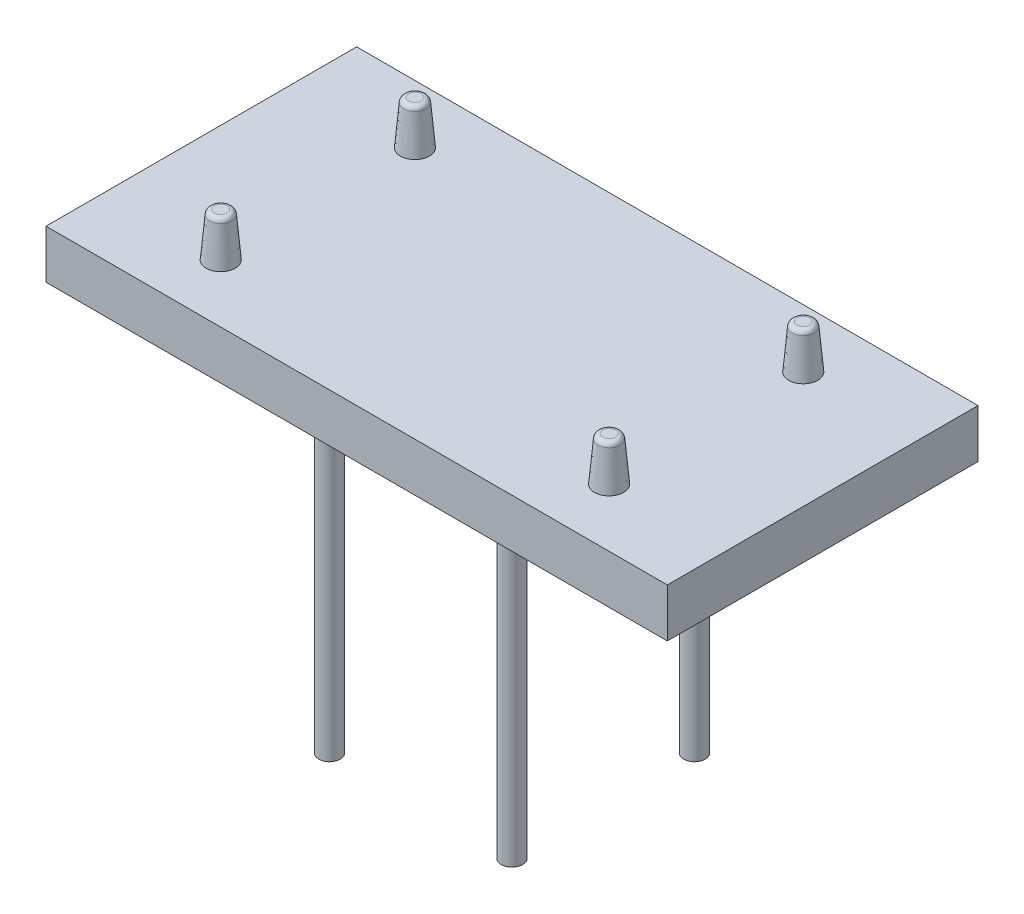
from build123d import *

# Parameters (mm, degrees)
SKETCH1_W                = 320
SKETCH1_H                = 160
EXTRUDE1_DEPTH           = 25
SKETCH1_3_R              = 7.5
EXTRUDE2_DEPTH           = 22.5
EXTRUDE2_DRAFT           = 5
EXTRUDE2_PROFILE_2_DEPTH = 22.5
EXTRUDE2_PROFILE_2_DRAFT = 5
EXTRUDE2_PROFILE_3_DEPTH = 22.5
EXTRUDE2_PROFILE_3_DRAFT = 5
EXTRUDE2_PROFILE_4_DEPTH = 22.5
EXTRUDE2_PROFILE_4_DRAFT = 5
FILLET1_R                = 2.5
SKETCH2_R                = 30
SKETCH2_R_2              = 15
EXTRUDE3_DEPTH           = 25
CHAMFER1_SIZE            = 10
SKETCH3_R                = 5.5
EXTRUDE4_DEPTH           = 170
SKETCH4_R                = 10.5
EXTRUDE5_DEPTH           = 15
CHAMFER3_SIZE            = 2


with BuildPart() as part:
    # Sketch1 → Extrude1 (new body)
    with BuildSketch(Plane(origin=(0, 0, 0), x_dir=(1, 0, 0), z_dir=(0, 1, 0))):
        Rectangle(SKETCH1_W, SKETCH1_H)
    extrude(amount=-EXTRUDE1_DEPTH)


with BuildPart() as extrude2_tool:
    # Sketch1_3 → Extrude2 (with draft: the straight prism first)
    with BuildSketch(Plane(origin=(0, 0, 0), x_dir=(1, 0, 0), z_dir=(0, 1, 0))):
        with Locations((100, 50)):
            Circle(SKETCH1_3_R)
    extrude(amount=EXTRUDE2_DEPTH)
    # Extrude2: the draft: its side faces are tilted about the plane it starts from
    extrude2_sides = [extrude2_tool.faces().sort_by_distance(p)[0] for p in [
        (92.5, 11.25, -50),
    ]]
    draft(extrude2_sides, Plane(origin=(0, 0, 0), x_dir=(1, 0, 0), z_dir=(0, 1, 0)), EXTRUDE2_DRAFT)


with BuildPart() as part_1:
    add(part.part)

    # Extrude2: add extrude2_tool
    add(extrude2_tool.part)


with BuildPart() as extrude2_profile_2_tool:
    # Sketch1_3 → Extrude2 profile 2 (with draft: the straight prism first)
    with BuildSketch(Plane(origin=(0, 0, 0), x_dir=(1, 0, 0), z_dir=(0, 1, 0))):
        with Locations((-100, 50)):
            Circle(SKETCH1_3_R)
    extrude(amount=EXTRUDE2_PROFILE_2_DEPTH)
    # Extrude2 profile 2: the draft: its side faces are tilted about the plane it starts from
    extrude2_profile_2_sides = [extrude2_profile_2_tool.faces().sort_by_distance(p)[0] for p in [
        (-107.5, 11.25, -50),
    ]]
    draft(extrude2_profile_2_sides, Plane(origin=(0, 0, 0), x_dir=(1, 0, 0), z_dir=(0, 1, 0)), EXTRUDE2_PROFILE_2_DRAFT)


with BuildPart() as part_2:
    add(part_1.part)

    # Extrude2 profile 2: add extrude2_profile_2_tool
    add(extrude2_profile_2_tool.part)


with BuildPart() as extrude2_profile_3_tool:
    # Sketch1_3 → Extrude2 profile 3 (with draft: the straight prism first)
    with BuildSketch(Plane(origin=(0, 0, 0), x_dir=(1, 0, 0), z_dir=(0, 1, 0))):
        with Locations((-100, -50)):
            Circle(SKETCH1_3_R)
    extrude(amount=EXTRUDE2_PROFILE_3_DEPTH)
    # Extrude2 profile 3: the draft: its side faces are tilted about the plane it starts from
    extrude2_profile_3_sides = [extrude2_profile_3_tool.faces().sort_by_distance(p)[0] for p in [
        (-107.5, 11.25, 50),
    ]]
    draft(extrude2_profile_3_sides, Plane(origin=(0, 0, 0), x_dir=(1, 0, 0), z_dir=(0, 1, 0)), EXTRUDE2_PROFILE_3_DRAFT)


with BuildPart() as part_3:
    add(part_2.part)

    # Extrude2 profile 3: add extrude2_profile_3_tool
    add(extrude2_profile_3_tool.part)


with BuildPart() as extrude2_profile_4_tool:
    # Sketch1_3 → Extrude2 profile 4 (with draft: the straight prism first)
    with BuildSketch(Plane(origin=(0, 0, 0), x_dir=(1, 0, 0), z_dir=(0, 1, 0))):
        with Locations((100, -50)):
            Circle(SKETCH1_3_R)
    extrude(amount=EXTRUDE2_PROFILE_4_DEPTH)
    # Extrude2 profile 4: the draft: its side faces are tilted about the plane it starts from
    extrude2_profile_4_sides = [extrude2_profile_4_tool.faces().sort_by_distance(p)[0] for p in [
        (92.5, 11.25, 50),
    ]]
    draft(extrude2_profile_4_sides, Plane(origin=(0, 0, 0), x_dir=(1, 0, 0), z_dir=(0, 1, 0)), EXTRUDE2_PROFILE_4_DRAFT)


with BuildPart() as part_4:
    add(part_3.part)

    # Extrude2 profile 4: add extrude2_profile_4_tool
    add(extrude2_profile_4_tool.part)

    # Fillet1
    fillet1_edges = [part_4.edges().sort_by_distance(p)[0] for p in [
        (-105.531505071, 22.5, 50),
        (-105.531505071, 22.5, -50),
        (94.468494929, 22.5, -50),
        (94.468494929, 22.5, 50),
    ]]
    fillet(fillet1_edges, radius=FILLET1_R)

    # Sketch2 → Extrude3 (add)
    with BuildSketch(Plane.XZ.offset(25)):
        with Locations(Location((0, 0, 0), (0, 0, 90))):
            Circle(SKETCH2_R)
        with Locations(Location((0, 0, 0), (0, 0, 270))):
            Circle(SKETCH2_R_2, mode=Mode.SUBTRACT)
    extrude(amount=EXTRUDE3_DEPTH)

    # Chamfer1
    chamfer1_edges = [part_4.edges().sort_by_distance(p)[0] for p in [
        (0, -25, -30),
    ]]
    chamfer(chamfer1_edges, length=CHAMFER1_SIZE)

    # Sketch3 → Extrude4 (add)
    with BuildSketch(Plane.XZ.offset(25)):
        with Locations(Location((-47, 47, 0), (0, 0, 90))):
            Circle(SKETCH3_R)
        with Locations(Location((47, 47, 0), (0, 0, 90))):
            Circle(SKETCH3_R)
        with Locations(Location((47, -47, 0), (0, 0, 90))):
            Circle(SKETCH3_R)
        with Locations(Location((-47, -47, 0), (0, 0, 90))):
            Circle(SKETCH3_R)
    extrude(amount=EXTRUDE4_DEPTH)

    # Sketch4 → Extrude5 (add)
    with BuildSketch(Plane.XZ.offset(25)):
        with Locations(Location((-47, 47, 0), (0, 0, 90))):
            Circle(SKETCH4_R)
        with Locations(Location((-47, -47, 0), (0, 0, 90))):
            Circle(SKETCH4_R)
        with Locations(Location((47, -47, 0), (0, 0, 90))):
            Circle(SKETCH4_R)
        with Locations(Location((47, 47, 0), (0, 0, 90))):
            Circle(SKETCH4_R)
    extrude(amount=EXTRUDE5_DEPTH)

    # Chamfer3
    chamfer3_edges = [part_4.edges().sort_by_distance(p)[0] for p in [
        (-47, -40, -57.5),
        (47, -40, -57.5),
        (47, -40, 36.5),
        (-47, -40, 36.5),
    ]]
    chamfer(chamfer3_edges, length=CHAMFER3_SIZE)


solid = part_4.part
